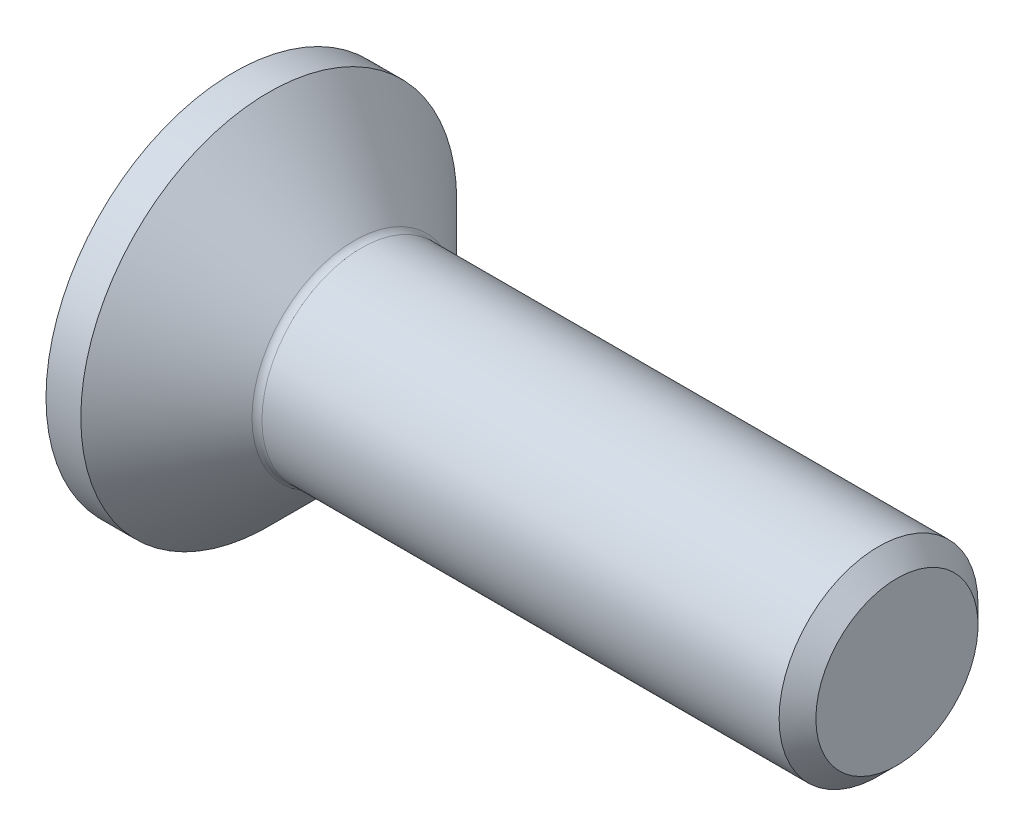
ISO-10303-21;
HEADER;
FILE_DESCRIPTION(('STEP AP214'),'2;1');
FILE_NAME('part.step','',(''),(''),'','','');
FILE_SCHEMA(('AUTOMOTIVE_DESIGN { 1 0 10303 214 1 1 1 1 }'));
ENDSEC;
DATA;
#1=APPLICATION_CONTEXT('core data for automotive mechanical design processes');
#2=APPLICATION_PROTOCOL_DEFINITION('international standard','automotive_design',2000,#1);
#3=PRODUCT_CONTEXT('',#1,'mechanical');
#4=PRODUCT('Part','Part','',(#3));
#5=PRODUCT_RELATED_PRODUCT_CATEGORY('part','',(#4));
#6=PRODUCT_DEFINITION_FORMATION('','',#4);
#7=PRODUCT_DEFINITION_CONTEXT('part definition',#1,'design');
#8=PRODUCT_DEFINITION('design','',#6,#7);
#9=PRODUCT_DEFINITION_SHAPE('','',#8);
#10=(LENGTH_UNIT() NAMED_UNIT(*) SI_UNIT(.MILLI.,.METRE.));
#11=(NAMED_UNIT(*) PLANE_ANGLE_UNIT() SI_UNIT($,.RADIAN.));
#12=(NAMED_UNIT(*) SI_UNIT($,.STERADIAN.) SOLID_ANGLE_UNIT());
#13=UNCERTAINTY_MEASURE_WITH_UNIT(LENGTH_MEASURE(1.E-05),#10,'distance_accuracy_value','');
#14=(GEOMETRIC_REPRESENTATION_CONTEXT(3) GLOBAL_UNCERTAINTY_ASSIGNED_CONTEXT((#13)) GLOBAL_UNIT_ASSIGNED_CONTEXT((#10,
#11,#12)) REPRESENTATION_CONTEXT('',''));
#15=CARTESIAN_POINT('',(0.,0.,0.));
#16=DIRECTION('',(0.,0.,1.));
#17=DIRECTION('',(1.,0.,0.));
#18=AXIS2_PLACEMENT_3D('',#15,#16,#17);
#19=CARTESIAN_POINT('',(0.,0.,0.));
#20=DIRECTION('',(-1.,0.,0.));
#21=DIRECTION('',(0.,0.,1.));
#22=AXIS2_PLACEMENT_3D('',#19,#20,#21);
#23=PLANE('',#22);
#24=CARTESIAN_POINT('',(0.,0.,0.));
#25=DIRECTION('',(-1.,0.,0.));
#26=DIRECTION('',(0.,0.,1.));
#27=AXIS2_PLACEMENT_3D('',#24,#25,#26);
#28=CIRCLE('',#27,5.67);
#29=CARTESIAN_POINT('',(0.,0.,5.67));
#30=VERTEX_POINT('',#29);
#31=EDGE_CURVE('E158',#30,#30,#28,.T.);
#32=ORIENTED_EDGE('',*,*,#31,.T.);
#33=EDGE_LOOP('',(#32));
#34=FACE_BOUND('',#33,.T.);
#35=DIRECTION('',(0.,-0.500000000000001,-0.866025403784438));
#36=VECTOR('',#35,1.);
#37=CARTESIAN_POINT('',(0.,-1.16047404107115,2.01));
#38=LINE('',#37,#36);
#39=CARTESIAN_POINT('',(0.,-1.16047404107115,2.01));
#40=VERTEX_POINT('',#39);
#41=CARTESIAN_POINT('',(0.,-2.3209480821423,0.));
#42=VERTEX_POINT('',#41);
#43=EDGE_CURVE('E120',#40,#42,#38,.T.);
#44=ORIENTED_EDGE('',*,*,#43,.T.);
#45=DIRECTION('',(0.,0.500000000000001,-0.866025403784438));
#46=VECTOR('',#45,1.);
#47=CARTESIAN_POINT('',(0.,-2.3209480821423,0.));
#48=LINE('',#47,#46);
#49=CARTESIAN_POINT('',(0.,-1.16047404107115,-2.01));
#50=VERTEX_POINT('',#49);
#51=EDGE_CURVE('E50',#42,#50,#48,.T.);
#52=ORIENTED_EDGE('',*,*,#51,.T.);
#53=DIRECTION('',(0.,1.,0.));
#54=VECTOR('',#53,1.);
#55=CARTESIAN_POINT('',(0.,-1.16047404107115,-2.01));
#56=LINE('',#55,#54);
#57=CARTESIAN_POINT('',(0.,1.16047404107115,-2.01));
#58=VERTEX_POINT('',#57);
#59=EDGE_CURVE('E135',#50,#58,#56,.T.);
#60=ORIENTED_EDGE('',*,*,#59,.T.);
#61=DIRECTION('',(0.,0.5,0.866025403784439));
#62=VECTOR('',#61,1.);
#63=CARTESIAN_POINT('',(0.,1.16047404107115,-2.01));
#64=LINE('',#63,#62);
#65=CARTESIAN_POINT('',(0.,2.32094808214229,0.));
#66=VERTEX_POINT('',#65);
#67=EDGE_CURVE('E271',#58,#66,#64,.T.);
#68=ORIENTED_EDGE('',*,*,#67,.T.);
#69=DIRECTION('',(0.,-0.5,0.866025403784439));
#70=VECTOR('',#69,1.);
#71=CARTESIAN_POINT('',(0.,2.32094808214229,0.));
#72=LINE('',#71,#70);
#73=CARTESIAN_POINT('',(0.,1.16047404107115,2.01));
#74=VERTEX_POINT('',#73);
#75=EDGE_CURVE('E274',#66,#74,#72,.T.);
#76=ORIENTED_EDGE('',*,*,#75,.T.);
#77=DIRECTION('',(0.,-1.,0.));
#78=VECTOR('',#77,1.);
#79=CARTESIAN_POINT('',(0.,1.16047404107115,2.01));
#80=LINE('',#79,#78);
#81=EDGE_CURVE('E277',#74,#40,#80,.T.);
#82=ORIENTED_EDGE('',*,*,#81,.T.);
#83=EDGE_LOOP('',(#44,#52,#60,#68,#76,#82));
#84=FACE_BOUND('',#83,.T.);
#85=ADVANCED_FACE('F35',(#34,#84),#23,.T.);
#86=CARTESIAN_POINT('',(0.,0.,0.));
#87=DIRECTION('',(-1.,0.,0.));
#88=DIRECTION('',(0.,0.,1.));
#89=AXIS2_PLACEMENT_3D('',#86,#87,#88);
#90=CYLINDRICAL_SURFACE('',#89,5.67);
#91=CARTESIAN_POINT('',(1.05000000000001,0.,0.));
#92=DIRECTION('',(-1.,0.,0.));
#93=DIRECTION('',(0.,0.,1.));
#94=AXIS2_PLACEMENT_3D('',#91,#92,#93);
#95=CIRCLE('',#94,5.67);
#96=CARTESIAN_POINT('',(1.05000000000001,0.,5.67));
#97=VERTEX_POINT('',#96);
#98=EDGE_CURVE('E155',#97,#97,#95,.T.);
#99=ORIENTED_EDGE('',*,*,#98,.T.);
#100=EDGE_LOOP('',(#99));
#101=FACE_BOUND('',#100,.T.);
#102=ORIENTED_EDGE('',*,*,#31,.F.);
#103=EDGE_LOOP('',(#102));
#104=FACE_BOUND('',#103,.T.);
#105=ADVANCED_FACE('F179',(#101,#104),#90,.T.);
#106=CARTESIAN_POINT('',(1.05000000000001,0.,0.));
#107=DIRECTION('',(-1.,0.,0.));
#108=DIRECTION('',(0.,0.,1.));
#109=AXIS2_PLACEMENT_3D('',#106,#107,#108);
#110=CONICAL_SURFACE('',#109,5.67,0.78539816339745);
#111=CARTESIAN_POINT('',(3.63213203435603,0.,0.));
#112=DIRECTION('',(-1.,0.,0.));
#113=DIRECTION('',(0.,0.,1.));
#114=AXIS2_PLACEMENT_3D('',#111,#112,#113);
#115=CIRCLE('',#114,3.08786796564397);
#116=CARTESIAN_POINT('',(3.63213203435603,0.,3.08786796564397));
#117=VERTEX_POINT('',#116);
#118=EDGE_CURVE('E43',#117,#117,#115,.T.);
#119=ORIENTED_EDGE('',*,*,#118,.T.);
#120=EDGE_LOOP('',(#119));
#121=FACE_BOUND('',#120,.T.);
#122=ORIENTED_EDGE('',*,*,#98,.F.);
#123=EDGE_LOOP('',(#122));
#124=FACE_BOUND('',#123,.T.);
#125=ADVANCED_FACE('F163',(#121,#124),#110,.T.);
#126=CARTESIAN_POINT('',(0.,0.,0.));
#127=DIRECTION('',(-1.,0.,0.));
#128=DIRECTION('',(0.,0.,1.));
#129=AXIS2_PLACEMENT_3D('',#126,#127,#128);
#130=CYLINDRICAL_SURFACE('',#129,2.99999999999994);
#131=CARTESIAN_POINT('',(3.844264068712,0.,0.));
#132=DIRECTION('',(-1.,0.,0.));
#133=DIRECTION('',(0.,0.,1.));
#134=AXIS2_PLACEMENT_3D('',#131,#132,#133);
#135=CIRCLE('',#134,2.99999999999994);
#136=CARTESIAN_POINT('',(3.844264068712,0.,2.99999999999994));
#137=VERTEX_POINT('',#136);
#138=EDGE_CURVE('E11',#137,#137,#135,.F.);
#139=ORIENTED_EDGE('',*,*,#138,.T.);
#140=EDGE_LOOP('',(#139));
#141=FACE_BOUND('',#140,.T.);
#142=CARTESIAN_POINT('',(19.4454999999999,0.,0.));
#143=DIRECTION('',(-1.,0.,0.));
#144=DIRECTION('',(0.,0.,1.));
#145=AXIS2_PLACEMENT_3D('',#142,#143,#144);
#146=CIRCLE('',#145,2.99999999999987);
#147=CARTESIAN_POINT('',(19.4454999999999,0.,2.99999999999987));
#148=VERTEX_POINT('',#147);
#149=EDGE_CURVE('E152',#148,#148,#146,.T.);
#150=ORIENTED_EDGE('',*,*,#149,.T.);
#151=EDGE_LOOP('',(#150));
#152=FACE_BOUND('',#151,.T.);
#153=ADVANCED_FACE('F190',(#141,#152),#130,.T.);
#154=CARTESIAN_POINT('',(20.,0.,0.));
#155=DIRECTION('',(-1.,0.,0.));
#156=DIRECTION('',(0.,0.,1.));
#157=AXIS2_PLACEMENT_3D('',#154,#155,#156);
#158=CONICAL_SURFACE('',#157,2.4455,0.785398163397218);
#159=ORIENTED_EDGE('',*,*,#149,.F.);
#160=EDGE_LOOP('',(#159));
#161=FACE_BOUND('',#160,.T.);
#162=CARTESIAN_POINT('',(20.,0.,0.));
#163=DIRECTION('',(-1.,0.,0.));
#164=DIRECTION('',(0.,0.,1.));
#165=AXIS2_PLACEMENT_3D('',#162,#163,#164);
#166=CIRCLE('',#165,2.4455);
#167=CARTESIAN_POINT('',(20.,0.,2.4455));
#168=VERTEX_POINT('',#167);
#169=EDGE_CURVE('E148',#168,#168,#166,.T.);
#170=ORIENTED_EDGE('',*,*,#169,.T.);
#171=EDGE_LOOP('',(#170));
#172=FACE_BOUND('',#171,.T.);
#173=ADVANCED_FACE('F174',(#161,#172),#158,.T.);
#174=CARTESIAN_POINT('',(20.,2.4455,0.));
#175=DIRECTION('',(1.,0.,0.));
#176=DIRECTION('',(0.,0.,-1.));
#177=AXIS2_PLACEMENT_3D('',#174,#175,#176);
#178=PLANE('',#177);
#179=ORIENTED_EDGE('',*,*,#169,.F.);
#180=EDGE_LOOP('',(#179));
#181=FACE_BOUND('',#180,.T.);
#182=ADVANCED_FACE('F167',(#181),#178,.T.);
#183=CARTESIAN_POINT('',(3.844264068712,0.,0.));
#184=DIRECTION('',(-1.,0.,0.));
#185=DIRECTION('',(0.,0.,1.));
#186=AXIS2_PLACEMENT_3D('',#183,#184,#185);
#187=TOROIDAL_SURFACE('',#186,3.29999999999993,0.3);
#188=ORIENTED_EDGE('',*,*,#138,.F.);
#189=EDGE_LOOP('',(#188));
#190=FACE_BOUND('',#189,.T.);
#191=ORIENTED_EDGE('',*,*,#118,.F.);
#192=EDGE_LOOP('',(#191));
#193=FACE_BOUND('',#192,.T.);
#194=ADVANCED_FACE('F37',(#190,#193),#187,.F.);
#195=CARTESIAN_POINT('',(2.2,-2.3209480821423,0.));
#196=DIRECTION('',(0.,0.866025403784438,0.500000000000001));
#197=DIRECTION('',(0.,-0.500000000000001,0.866025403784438));
#198=AXIS2_PLACEMENT_3D('',#195,#196,#197);
#199=PLANE('',#198);
#200=ORIENTED_EDGE('',*,*,#51,.F.);
#201=DIRECTION('',(-1.,0.,0.));
#202=VECTOR('',#201,1.);
#203=CARTESIAN_POINT('',(2.2,-2.3209480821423,0.));
#204=LINE('',#203,#202);
#205=CARTESIAN_POINT('',(2.2,-2.3209480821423,0.));
#206=VERTEX_POINT('',#205);
#207=EDGE_CURVE('E268',#206,#42,#204,.T.);
#208=ORIENTED_EDGE('',*,*,#207,.F.);
#209=DIRECTION('',(0.,0.500000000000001,-0.866025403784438));
#210=VECTOR('',#209,1.);
#211=CARTESIAN_POINT('',(2.2,-2.3209480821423,0.));
#212=LINE('',#211,#210);
#213=CARTESIAN_POINT('',(2.2,-1.74071106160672,-1.005));
#214=VERTEX_POINT('',#213);
#215=EDGE_CURVE('E117',#206,#214,#212,.T.);
#216=ORIENTED_EDGE('',*,*,#215,.T.);
#217=CARTESIAN_POINT('',(2.2,-1.16047404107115,-2.01));
#218=VERTEX_POINT('',#217);
#219=EDGE_CURVE('E111',#214,#218,#212,.T.);
#220=ORIENTED_EDGE('',*,*,#219,.T.);
#221=DIRECTION('',(-1.,0.,0.));
#222=VECTOR('',#221,1.);
#223=CARTESIAN_POINT('',(2.2,-1.16047404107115,-2.01));
#224=LINE('',#223,#222);
#225=EDGE_CURVE('E115',#218,#50,#224,.T.);
#226=ORIENTED_EDGE('',*,*,#225,.T.);
#227=EDGE_LOOP('',(#200,#208,#216,#220,#226));
#228=FACE_BOUND('',#227,.T.);
#229=ADVANCED_FACE('F113',(#228),#199,.T.);
#230=CARTESIAN_POINT('',(2.2,-1.16047404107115,-2.01));
#231=DIRECTION('',(0.,0.,1.));
#232=DIRECTION('',(1.,0.,0.));
#233=AXIS2_PLACEMENT_3D('',#230,#231,#232);
#234=PLANE('',#233);
#235=ORIENTED_EDGE('',*,*,#59,.F.);
#236=ORIENTED_EDGE('',*,*,#225,.F.);
#237=DIRECTION('',(0.,1.,0.));
#238=VECTOR('',#237,1.);
#239=CARTESIAN_POINT('',(2.2,-1.16047404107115,-2.01));
#240=LINE('',#239,#238);
#241=CARTESIAN_POINT('',(2.2,0.,-2.01));
#242=VERTEX_POINT('',#241);
#243=EDGE_CURVE('E123',#218,#242,#240,.T.);
#244=ORIENTED_EDGE('',*,*,#243,.T.);
#245=CARTESIAN_POINT('',(2.2,1.16047404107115,-2.01));
#246=VERTEX_POINT('',#245);
#247=EDGE_CURVE('E130',#242,#246,#240,.T.);
#248=ORIENTED_EDGE('',*,*,#247,.T.);
#249=DIRECTION('',(-1.,0.,0.));
#250=VECTOR('',#249,1.);
#251=CARTESIAN_POINT('',(2.2,1.16047404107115,-2.01));
#252=LINE('',#251,#250);
#253=EDGE_CURVE('E137',#246,#58,#252,.T.);
#254=ORIENTED_EDGE('',*,*,#253,.T.);
#255=EDGE_LOOP('',(#235,#236,#244,#248,#254));
#256=FACE_BOUND('',#255,.T.);
#257=ADVANCED_FACE('F132',(#256),#234,.T.);
#258=CARTESIAN_POINT('',(2.2,1.16047404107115,-2.01));
#259=DIRECTION('',(0.,-0.866025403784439,0.5));
#260=DIRECTION('',(0.,-0.5,-0.866025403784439));
#261=AXIS2_PLACEMENT_3D('',#258,#259,#260);
#262=PLANE('',#261);
#263=ORIENTED_EDGE('',*,*,#67,.F.);
#264=ORIENTED_EDGE('',*,*,#253,.F.);
#265=DIRECTION('',(0.,0.5,0.866025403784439));
#266=VECTOR('',#265,1.);
#267=CARTESIAN_POINT('',(2.2,1.16047404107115,-2.01));
#268=LINE('',#267,#266);
#269=CARTESIAN_POINT('',(2.2,1.74071106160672,-1.005));
#270=VERTEX_POINT('',#269);
#271=EDGE_CURVE('E260',#246,#270,#268,.T.);
#272=ORIENTED_EDGE('',*,*,#271,.T.);
#273=CARTESIAN_POINT('',(2.2,2.32094808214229,0.));
#274=VERTEX_POINT('',#273);
#275=EDGE_CURVE('E129',#270,#274,#268,.T.);
#276=ORIENTED_EDGE('',*,*,#275,.T.);
#277=DIRECTION('',(-1.,0.,0.));
#278=VECTOR('',#277,1.);
#279=CARTESIAN_POINT('',(2.2,2.32094808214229,0.));
#280=LINE('',#279,#278);
#281=EDGE_CURVE('E143',#274,#66,#280,.T.);
#282=ORIENTED_EDGE('',*,*,#281,.T.);
#283=EDGE_LOOP('',(#263,#264,#272,#276,#282));
#284=FACE_BOUND('',#283,.T.);
#285=ADVANCED_FACE('F204',(#284),#262,.T.);
#286=CARTESIAN_POINT('',(2.2,2.32094808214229,0.));
#287=DIRECTION('',(0.,-0.866025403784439,-0.5));
#288=DIRECTION('',(0.,0.5,-0.866025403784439));
#289=AXIS2_PLACEMENT_3D('',#286,#287,#288);
#290=PLANE('',#289);
#291=ORIENTED_EDGE('',*,*,#75,.F.);
#292=ORIENTED_EDGE('',*,*,#281,.F.);
#293=DIRECTION('',(0.,-0.5,0.866025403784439));
#294=VECTOR('',#293,1.);
#295=CARTESIAN_POINT('',(2.2,2.32094808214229,0.));
#296=LINE('',#295,#294);
#297=CARTESIAN_POINT('',(2.2,1.74071106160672,1.005));
#298=VERTEX_POINT('',#297);
#299=EDGE_CURVE('E58',#274,#298,#296,.T.);
#300=ORIENTED_EDGE('',*,*,#299,.T.);
#301=CARTESIAN_POINT('',(2.2,1.16047404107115,2.01));
#302=VERTEX_POINT('',#301);
#303=EDGE_CURVE('E239',#298,#302,#296,.T.);
#304=ORIENTED_EDGE('',*,*,#303,.T.);
#305=DIRECTION('',(-1.,0.,0.));
#306=VECTOR('',#305,1.);
#307=CARTESIAN_POINT('',(2.2,1.16047404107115,2.01));
#308=LINE('',#307,#306);
#309=EDGE_CURVE('E253',#302,#74,#308,.T.);
#310=ORIENTED_EDGE('',*,*,#309,.T.);
#311=EDGE_LOOP('',(#291,#292,#300,#304,#310));
#312=FACE_BOUND('',#311,.T.);
#313=ADVANCED_FACE('F207',(#312),#290,.T.);
#314=CARTESIAN_POINT('',(2.2,1.16047404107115,2.01));
#315=DIRECTION('',(0.,0.,-1.));
#316=DIRECTION('',(-1.,0.,0.));
#317=AXIS2_PLACEMENT_3D('',#314,#315,#316);
#318=PLANE('',#317);
#319=ORIENTED_EDGE('',*,*,#81,.F.);
#320=ORIENTED_EDGE('',*,*,#309,.F.);
#321=DIRECTION('',(0.,-1.,0.));
#322=VECTOR('',#321,1.);
#323=CARTESIAN_POINT('',(2.2,1.16047404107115,2.01));
#324=LINE('',#323,#322);
#325=CARTESIAN_POINT('',(2.2,0.,2.01));
#326=VERTEX_POINT('',#325);
#327=EDGE_CURVE('E238',#302,#326,#324,.T.);
#328=ORIENTED_EDGE('',*,*,#327,.T.);
#329=CARTESIAN_POINT('',(2.2,-1.16047404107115,2.01));
#330=VERTEX_POINT('',#329);
#331=EDGE_CURVE('E244',#326,#330,#324,.T.);
#332=ORIENTED_EDGE('',*,*,#331,.T.);
#333=DIRECTION('',(-1.,0.,0.));
#334=VECTOR('',#333,1.);
#335=CARTESIAN_POINT('',(2.2,-1.16047404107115,2.01));
#336=LINE('',#335,#334);
#337=EDGE_CURVE('E283',#330,#40,#336,.T.);
#338=ORIENTED_EDGE('',*,*,#337,.T.);
#339=EDGE_LOOP('',(#319,#320,#328,#332,#338));
#340=FACE_BOUND('',#339,.T.);
#341=ADVANCED_FACE('F211',(#340),#318,.T.);
#342=CARTESIAN_POINT('',(2.2,-1.16047404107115,2.01));
#343=DIRECTION('',(0.,0.866025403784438,-0.500000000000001));
#344=DIRECTION('',(0.,0.500000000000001,0.866025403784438));
#345=AXIS2_PLACEMENT_3D('',#342,#343,#344);
#346=PLANE('',#345);
#347=ORIENTED_EDGE('',*,*,#43,.F.);
#348=ORIENTED_EDGE('',*,*,#337,.F.);
#349=DIRECTION('',(0.,-0.500000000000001,-0.866025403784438));
#350=VECTOR('',#349,1.);
#351=CARTESIAN_POINT('',(2.2,-1.16047404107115,2.01));
#352=LINE('',#351,#350);
#353=CARTESIAN_POINT('',(2.2,-1.74071106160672,1.005));
#354=VERTEX_POINT('',#353);
#355=EDGE_CURVE('E247',#330,#354,#352,.T.);
#356=ORIENTED_EDGE('',*,*,#355,.T.);
#357=EDGE_CURVE('E254',#354,#206,#352,.T.);
#358=ORIENTED_EDGE('',*,*,#357,.T.);
#359=ORIENTED_EDGE('',*,*,#207,.T.);
#360=EDGE_LOOP('',(#347,#348,#356,#358,#359));
#361=FACE_BOUND('',#360,.T.);
#362=ADVANCED_FACE('F214',(#361),#346,.T.);
#363=CARTESIAN_POINT('',(2.2,-2.3209480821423,0.));
#364=DIRECTION('',(-1.,0.,0.));
#365=DIRECTION('',(0.,0.,1.));
#366=AXIS2_PLACEMENT_3D('',#363,#364,#365);
#367=PLANE('',#366);
#368=CARTESIAN_POINT('',(2.2,0.,0.));
#369=DIRECTION('',(-1.,0.,0.));
#370=DIRECTION('',(0.,0.,1.));
#371=AXIS2_PLACEMENT_3D('',#368,#369,#370);
#372=CIRCLE('',#371,2.01);
#373=EDGE_CURVE('E136',#354,#326,#372,.T.);
#374=ORIENTED_EDGE('',*,*,#373,.F.);
#375=ORIENTED_EDGE('',*,*,#355,.F.);
#376=ORIENTED_EDGE('',*,*,#331,.F.);
#377=EDGE_LOOP('',(#374,#375,#376));
#378=FACE_BOUND('',#377,.T.);
#379=ADVANCED_FACE('F218',(#378),#367,.T.);
#380=EDGE_CURVE('E140',#214,#354,#372,.T.);
#381=ORIENTED_EDGE('',*,*,#380,.F.);
#382=ORIENTED_EDGE('',*,*,#215,.F.);
#383=ORIENTED_EDGE('',*,*,#357,.F.);
#384=EDGE_LOOP('',(#381,#382,#383));
#385=FACE_BOUND('',#384,.T.);
#386=ADVANCED_FACE('F221',(#385),#367,.T.);
#387=EDGE_CURVE('E125',#242,#214,#372,.T.);
#388=ORIENTED_EDGE('',*,*,#387,.F.);
#389=ORIENTED_EDGE('',*,*,#243,.F.);
#390=ORIENTED_EDGE('',*,*,#219,.F.);
#391=EDGE_LOOP('',(#388,#389,#390));
#392=FACE_BOUND('',#391,.T.);
#393=ADVANCED_FACE('F124',(#392),#367,.T.);
#394=EDGE_CURVE('E256',#270,#242,#372,.T.);
#395=ORIENTED_EDGE('',*,*,#394,.F.);
#396=ORIENTED_EDGE('',*,*,#271,.F.);
#397=ORIENTED_EDGE('',*,*,#247,.F.);
#398=EDGE_LOOP('',(#395,#396,#397));
#399=FACE_BOUND('',#398,.T.);
#400=ADVANCED_FACE('F233',(#399),#367,.T.);
#401=EDGE_CURVE('E149',#298,#270,#372,.T.);
#402=ORIENTED_EDGE('',*,*,#401,.F.);
#403=ORIENTED_EDGE('',*,*,#299,.F.);
#404=ORIENTED_EDGE('',*,*,#275,.F.);
#405=EDGE_LOOP('',(#402,#403,#404));
#406=FACE_BOUND('',#405,.T.);
#407=ADVANCED_FACE('F228',(#406),#367,.T.);
#408=EDGE_CURVE('E142',#326,#298,#372,.T.);
#409=ORIENTED_EDGE('',*,*,#408,.F.);
#410=ORIENTED_EDGE('',*,*,#327,.F.);
#411=ORIENTED_EDGE('',*,*,#303,.F.);
#412=EDGE_LOOP('',(#409,#410,#411));
#413=FACE_BOUND('',#412,.T.);
#414=ADVANCED_FACE('F199',(#413),#367,.T.);
#415=CARTESIAN_POINT('',(2.2,0.,0.));
#416=DIRECTION('',(-1.,0.,0.));
#417=DIRECTION('',(0.,0.,1.));
#418=AXIS2_PLACEMENT_3D('',#415,#416,#417);
#419=CONICAL_SURFACE('',#418,2.01,1.04719755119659);
#420=CARTESIAN_POINT('',(3.36047404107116,0.,0.));
#421=VERTEX_POINT('',#420);
#422=VERTEX_LOOP('',#421);
#423=FACE_BOUND('',#422,.T.);
#424=ORIENTED_EDGE('',*,*,#408,.T.);
#425=ORIENTED_EDGE('',*,*,#401,.T.);
#426=ORIENTED_EDGE('',*,*,#394,.T.);
#427=ORIENTED_EDGE('',*,*,#387,.T.);
#428=ORIENTED_EDGE('',*,*,#380,.T.);
#429=ORIENTED_EDGE('',*,*,#373,.T.);
#430=EDGE_LOOP('',(#424,#425,#426,#427,#428,#429));
#431=FACE_BOUND('',#430,.T.);
#432=ADVANCED_FACE('F197',(#423,#431),#419,.F.);
#433=CLOSED_SHELL('',(#85,#105,#125,#153,#173,#182,#194,#229,#257,#285,#313,#341,#362,#379,#386,
#393,#400,#407,#414,#432));
#434=MANIFOLD_SOLID_BREP('B2',#433);
#435=ADVANCED_BREP_SHAPE_REPRESENTATION('',(#18,#434),#14);
#436=SHAPE_DEFINITION_REPRESENTATION(#9,#435);
ENDSEC;
END-ISO-10303-21;
